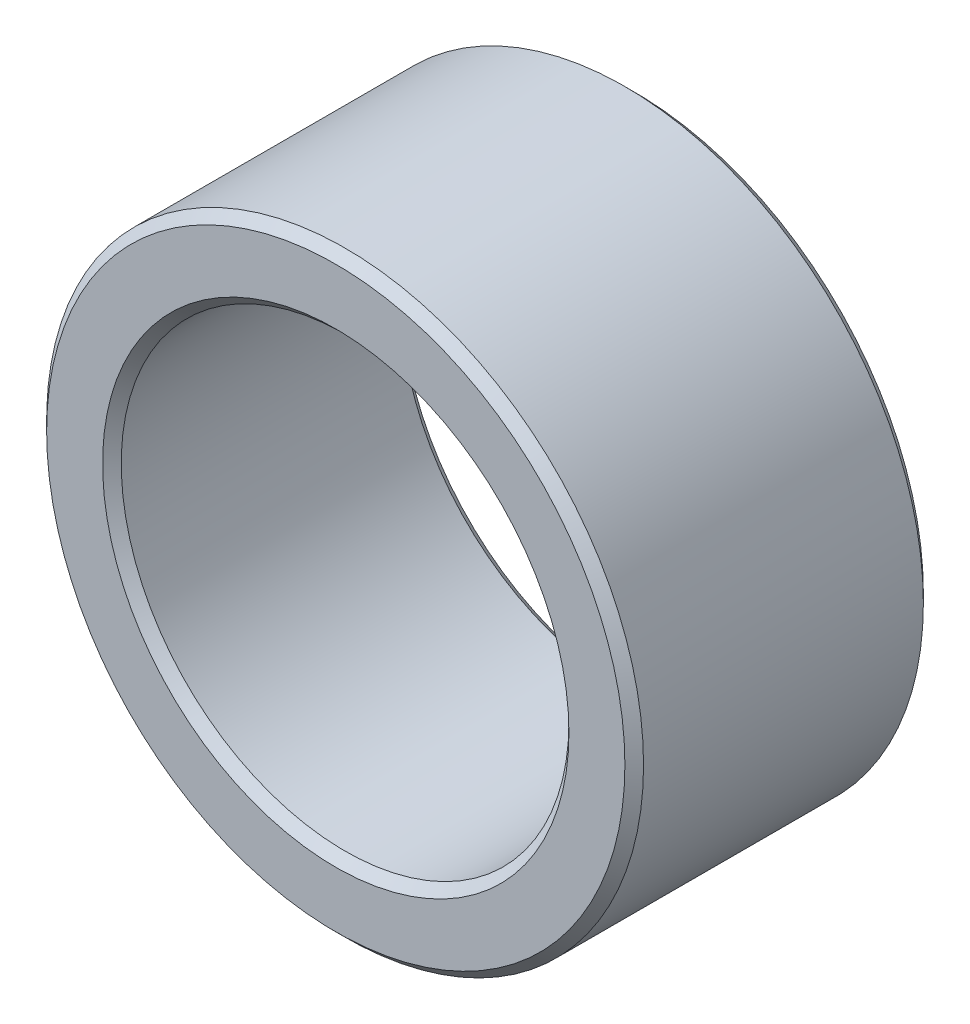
from build123d import *

# Parameters (mm, degrees)
ESQUISSE2_R          = 16
ESQUISSE2_R_2        = 12
BASE_EXTRUSION_DEPTH = 16
CHANFREIN1_SIZE      = 0.5


with BuildPart() as part:
    # Esquisse2 → Base-Extrusion (new body)
    with BuildSketch(Plane.XY):
        Circle(ESQUISSE2_R)
        Circle(ESQUISSE2_R_2, mode=Mode.SUBTRACT)
    extrude(amount=BASE_EXTRUSION_DEPTH)

    # Chanfrein1
    chanfrein1_edges = [part.edges().sort_by_distance(p)[0] for p in [
        (-16, 0, 0),
        (-16, 0, 16),
        (-12, 0, 0),
        (-12, 0, 16),
    ]]
    chamfer(chanfrein1_edges, length=CHANFREIN1_SIZE)


solid = part.part
